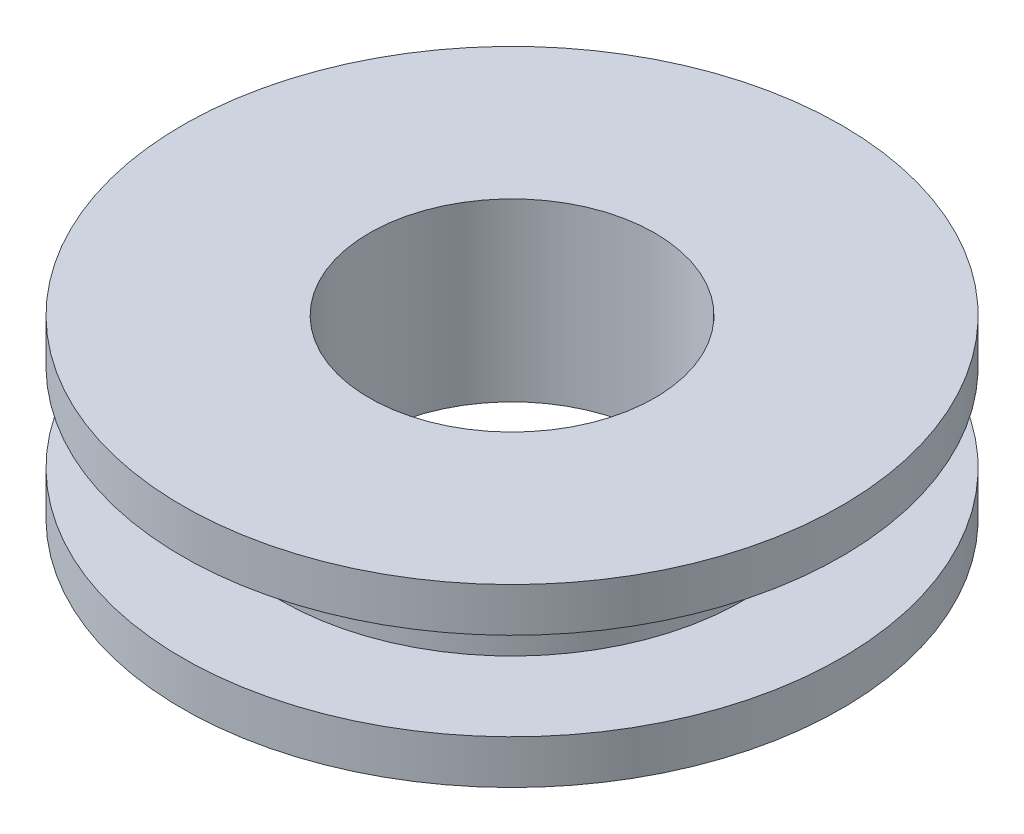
from build123d import *


with BuildPart() as part:
    # Sketch1 → Revolve1 (revolve)
    with BuildSketch(Plane(origin=(0, 0, 0), x_dir=(0, 0, -1), z_dir=(1, 0, 0))):
        Polygon((75, 10), (75, 20), (32.5, 20), (32.5, -20), (75, -20), (75, -10), (52.5, -10), (52.5, 10), align=None)
    revolve(axis=Axis((0, -66.306228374, 0), (0, 1, 0)))


solid = part.part
